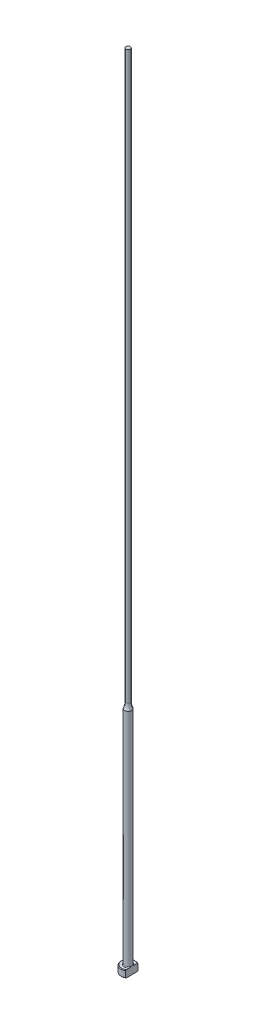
ISO-10303-21;
HEADER;
FILE_DESCRIPTION(('STEP AP214'),'2;1');
FILE_NAME('part.step','',(''),(''),'','','');
FILE_SCHEMA(('AUTOMOTIVE_DESIGN { 1 0 10303 214 1 1 1 1 }'));
ENDSEC;
DATA;
#1=APPLICATION_CONTEXT('core data for automotive mechanical design processes');
#2=APPLICATION_PROTOCOL_DEFINITION('international standard','automotive_design',2000,#1);
#3=PRODUCT_CONTEXT('',#1,'mechanical');
#4=PRODUCT('Part','Part','',(#3));
#5=PRODUCT_RELATED_PRODUCT_CATEGORY('part','',(#4));
#6=PRODUCT_DEFINITION_FORMATION('','',#4);
#7=PRODUCT_DEFINITION_CONTEXT('part definition',#1,'design');
#8=PRODUCT_DEFINITION('design','',#6,#7);
#9=PRODUCT_DEFINITION_SHAPE('','',#8);
#10=(LENGTH_UNIT() NAMED_UNIT(*) SI_UNIT(.MILLI.,.METRE.));
#11=(NAMED_UNIT(*) PLANE_ANGLE_UNIT() SI_UNIT($,.RADIAN.));
#12=(NAMED_UNIT(*) SI_UNIT($,.STERADIAN.) SOLID_ANGLE_UNIT());
#13=UNCERTAINTY_MEASURE_WITH_UNIT(LENGTH_MEASURE(1.E-05),#10,'distance_accuracy_value','');
#14=(GEOMETRIC_REPRESENTATION_CONTEXT(3) GLOBAL_UNCERTAINTY_ASSIGNED_CONTEXT((#13)) GLOBAL_UNIT_ASSIGNED_CONTEXT((#10,
#11,#12)) REPRESENTATION_CONTEXT('',''));
#15=CARTESIAN_POINT('',(0.,0.,0.));
#16=DIRECTION('',(0.,0.,1.));
#17=DIRECTION('',(1.,0.,0.));
#18=AXIS2_PLACEMENT_3D('',#15,#16,#17);
#19=CARTESIAN_POINT('',(-3.17499999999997,3.175,0.));
#20=DIRECTION('',(0.,1.,0.));
#21=DIRECTION('',(0.,0.,1.));
#22=AXIS2_PLACEMENT_3D('',#19,#20,#21);
#23=PLANE('',#22);
#24=CARTESIAN_POINT('',(0.,3.175,0.));
#25=DIRECTION('',(0.,1.,0.));
#26=DIRECTION('',(0.,0.,1.));
#27=AXIS2_PLACEMENT_3D('',#24,#25,#26);
#28=CIRCLE('',#27,2.92099999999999);
#29=CARTESIAN_POINT('',(1.58749999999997,3.175,-2.4519552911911));
#30=VERTEX_POINT('',#29);
#31=CARTESIAN_POINT('',(1.58749999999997,3.175,2.4519552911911));
#32=VERTEX_POINT('',#31);
#33=EDGE_CURVE('E105',#30,#32,#28,.T.);
#34=ORIENTED_EDGE('',*,*,#33,.T.);
#35=DIRECTION('',(0.,0.,1.));
#36=VECTOR('',#35,1.);
#37=CARTESIAN_POINT('',(1.58749999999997,3.17499999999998,2.74963065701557));
#38=LINE('',#37,#36);
#39=CARTESIAN_POINT('',(1.58749999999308,3.175,0.933255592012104));
#40=VERTEX_POINT('',#39);
#41=EDGE_CURVE('E126',#40,#32,#38,.T.);
#42=ORIENTED_EDGE('',*,*,#41,.F.);
#43=CARTESIAN_POINT('',(0.,3.175,0.));
#44=DIRECTION('',(0.,1.,0.));
#45=DIRECTION('',(0.,0.,1.));
#46=AXIS2_PLACEMENT_3D('',#43,#44,#45);
#47=CIRCLE('',#46,1.84149999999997);
#48=CARTESIAN_POINT('',(1.58749999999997,3.17500000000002,-0.933255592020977));
#49=VERTEX_POINT('',#48);
#50=EDGE_CURVE('E11',#40,#49,#47,.F.);
#51=ORIENTED_EDGE('',*,*,#50,.T.);
#52=EDGE_CURVE('E52',#30,#49,#38,.T.);
#53=ORIENTED_EDGE('',*,*,#52,.F.);
#54=EDGE_LOOP('',(#34,#42,#51,#53));
#55=FACE_BOUND('',#54,.T.);
#56=ADVANCED_FACE('F32',(#55),#23,.T.);
#57=CARTESIAN_POINT('',(0.,259.958771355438,0.));
#58=DIRECTION('',(0.,1.,0.));
#59=DIRECTION('',(0.,0.,1.));
#60=AXIS2_PLACEMENT_3D('',#57,#58,#59);
#61=CYLINDRICAL_SURFACE('',#60,3.17499999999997);
#62=CARTESIAN_POINT('',(0.,2.92100000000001,0.));
#63=DIRECTION('',(0.,1.,0.));
#64=DIRECTION('',(0.,0.,1.));
#65=AXIS2_PLACEMENT_3D('',#62,#63,#64);
#66=CIRCLE('',#65,3.17499999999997);
#67=CARTESIAN_POINT('',(1.58749999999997,2.92100000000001,2.74963065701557));
#68=VERTEX_POINT('',#67);
#69=CARTESIAN_POINT('',(1.58749999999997,2.92100000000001,-2.74963065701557));
#70=VERTEX_POINT('',#69);
#71=EDGE_CURVE('E98',#68,#70,#66,.F.);
#72=ORIENTED_EDGE('',*,*,#71,.T.);
#73=DIRECTION('',(0.,-1.,0.));
#74=VECTOR('',#73,1.);
#75=CARTESIAN_POINT('',(1.58749999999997,355.601,-2.74963065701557));
#76=LINE('',#75,#74);
#77=CARTESIAN_POINT('',(1.58749999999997,0.253999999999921,-2.74963065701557));
#78=VERTEX_POINT('',#77);
#79=EDGE_CURVE('E141',#70,#78,#76,.T.);
#80=ORIENTED_EDGE('',*,*,#79,.T.);
#81=CARTESIAN_POINT('',(0.,0.253999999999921,0.));
#82=DIRECTION('',(0.,-1.,0.));
#83=DIRECTION('',(0.,0.,-1.));
#84=AXIS2_PLACEMENT_3D('',#81,#82,#83);
#85=CIRCLE('',#84,3.17499999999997);
#86=CARTESIAN_POINT('',(1.58749999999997,0.253999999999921,2.74963065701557));
#87=VERTEX_POINT('',#86);
#88=EDGE_CURVE('E95',#78,#87,#85,.F.);
#89=ORIENTED_EDGE('',*,*,#88,.T.);
#90=DIRECTION('',(0.,-1.,0.));
#91=VECTOR('',#90,1.);
#92=CARTESIAN_POINT('',(1.58749999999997,355.601,2.74963065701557));
#93=LINE('',#92,#91);
#94=EDGE_CURVE('E88',#68,#87,#93,.T.);
#95=ORIENTED_EDGE('',*,*,#94,.F.);
#96=EDGE_LOOP('',(#72,#80,#89,#95));
#97=FACE_BOUND('',#96,.T.);
#98=ADVANCED_FACE('F191',(#97),#61,.T.);
#99=CARTESIAN_POINT('',(0.,0.,0.));
#100=DIRECTION('',(0.,-1.,0.));
#101=DIRECTION('',(0.,0.,-1.));
#102=AXIS2_PLACEMENT_3D('',#99,#100,#101);
#103=PLANE('',#102);
#104=CARTESIAN_POINT('',(0.,0.,0.));
#105=DIRECTION('',(0.,-1.,0.));
#106=DIRECTION('',(0.,0.,-1.));
#107=AXIS2_PLACEMENT_3D('',#104,#105,#106);
#108=CIRCLE('',#107,2.92100000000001);
#109=CARTESIAN_POINT('',(1.58749999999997,0.,2.45195529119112));
#110=VERTEX_POINT('',#109);
#111=CARTESIAN_POINT('',(1.58749999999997,0.,-2.45195529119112));
#112=VERTEX_POINT('',#111);
#113=EDGE_CURVE('E93',#110,#112,#108,.T.);
#114=ORIENTED_EDGE('',*,*,#113,.T.);
#115=DIRECTION('',(0.,0.,1.));
#116=VECTOR('',#115,1.);
#117=CARTESIAN_POINT('',(1.58749999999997,0.,2.74963065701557));
#118=LINE('',#117,#116);
#119=EDGE_CURVE('E78',#112,#110,#118,.T.);
#120=ORIENTED_EDGE('',*,*,#119,.T.);
#121=EDGE_LOOP('',(#114,#120));
#122=FACE_BOUND('',#121,.T.);
#123=ADVANCED_FACE('F97',(#122),#103,.T.);
#124=CARTESIAN_POINT('',(0.,3.17499999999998,0.));
#125=DIRECTION('',(0.,-1.,0.));
#126=DIRECTION('',(0.,0.,-1.));
#127=AXIS2_PLACEMENT_3D('',#124,#125,#126);
#128=CONICAL_SURFACE('',#127,2.92100000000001,0.785398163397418);
#129=ORIENTED_EDGE('',*,*,#71,.F.);
#130=CARTESIAN_POINT('',(1.58749999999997,-0.161620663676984,-6.0529050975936));
#131=CARTESIAN_POINT('',(1.58749999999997,-0.0288893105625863,-5.91567682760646));
#132=CARTESIAN_POINT('',(1.58749999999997,0.103699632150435,-5.77831035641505));
#133=CARTESIAN_POINT('',(1.58749999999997,0.368508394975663,-5.50321874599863));
#134=CARTESIAN_POINT('',(1.58749999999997,0.5007282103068,-5.3654936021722));
#135=CARTESIAN_POINT('',(1.58749999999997,0.764778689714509,-5.08953516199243));
#136=CARTESIAN_POINT('',(1.58749999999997,0.896609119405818,-4.95130164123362));
#137=CARTESIAN_POINT('',(1.58749999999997,1.15968706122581,-4.67428233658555));
#138=CARTESIAN_POINT('',(1.58749999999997,1.29093457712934,-4.5354965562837));
#139=CARTESIAN_POINT('',(1.58749999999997,1.55007705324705,-4.25997724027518));
#140=CARTESIAN_POINT('',(1.58749999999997,1.67798684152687,-4.12325766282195));
#141=CARTESIAN_POINT('',(1.58749999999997,1.9328486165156,-3.84892898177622));
#142=CARTESIAN_POINT('',(1.58749999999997,2.05980060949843,-3.71131988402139));
#143=CARTESIAN_POINT('',(1.58749999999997,2.31237508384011,-3.43493978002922));
#144=CARTESIAN_POINT('',(1.58749999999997,2.43799784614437,-3.29616903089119));
#145=CARTESIAN_POINT('',(1.58749999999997,2.68741369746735,-3.01699558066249));
#146=CARTESIAN_POINT('',(1.58749999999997,2.81120686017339,-2.8765929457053));
#147=CARTESIAN_POINT('',(1.58749999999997,3.00875865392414,-2.64816703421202));
#148=CARTESIAN_POINT('',(1.58749999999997,3.08336151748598,-2.56087478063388));
#149=CARTESIAN_POINT('',(1.58749999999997,3.23123871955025,-2.385154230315));
#150=CARTESIAN_POINT('',(1.58749999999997,3.30451292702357,-2.29672582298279));
#151=CARTESIAN_POINT('',(1.58749999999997,3.45004422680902,-2.11747400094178));
#152=CARTESIAN_POINT('',(1.58749999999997,3.52228237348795,-2.02663514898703));
#153=CARTESIAN_POINT('',(1.58749999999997,3.66423097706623,-1.84302524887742));
#154=CARTESIAN_POINT('',(1.58749999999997,3.73394203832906,-1.75025467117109));
#155=CARTESIAN_POINT('',(1.58749999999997,3.87080633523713,-1.56067475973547));
#156=CARTESIAN_POINT('',(1.58749999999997,3.93790459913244,-1.46382547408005));
#157=CARTESIAN_POINT('',(1.58749999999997,4.06669147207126,-1.26632594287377));
#158=CARTESIAN_POINT('',(1.58749999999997,4.12837264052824,-1.16567073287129));
#159=CARTESIAN_POINT('',(1.58749999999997,4.21402252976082,-1.01165766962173));
#160=CARTESIAN_POINT('',(1.58749999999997,4.2412792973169,-0.960142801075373));
#161=CARTESIAN_POINT('',(1.58749999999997,4.29309798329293,-0.85578092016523));
#162=CARTESIAN_POINT('',(1.58749999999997,4.3176594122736,-0.802933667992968));
#163=CARTESIAN_POINT('',(1.58749999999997,4.38614656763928,-0.642461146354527));
#164=CARTESIAN_POINT('',(1.58749999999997,4.42510149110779,-0.532518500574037));
#165=CARTESIAN_POINT('',(1.58749999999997,4.46726244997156,-0.367680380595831));
#166=CARTESIAN_POINT('',(1.58749999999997,4.47844427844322,-0.314802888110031));
#167=CARTESIAN_POINT('',(1.58749999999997,4.49576654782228,-0.208209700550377));
#168=CARTESIAN_POINT('',(1.58749999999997,4.50190743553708,-0.154494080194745));
#169=CARTESIAN_POINT('',(1.58749999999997,4.50871296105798,-0.0468792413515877));
#170=CARTESIAN_POINT('',(1.58749999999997,4.50939451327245,0.00701889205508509));
#171=CARTESIAN_POINT('',(1.58749999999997,4.5052767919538,0.114606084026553));
#172=CARTESIAN_POINT('',(1.58749999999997,4.5004770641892,0.16829512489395));
#173=CARTESIAN_POINT('',(1.58749999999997,4.48579689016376,0.274485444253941));
#174=CARTESIAN_POINT('',(1.58749999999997,4.47596081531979,0.326992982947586));
#175=CARTESIAN_POINT('',(1.58749999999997,4.4518180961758,0.430974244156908));
#176=CARTESIAN_POINT('',(1.58749999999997,4.43750969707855,0.482447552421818));
#177=CARTESIAN_POINT('',(1.58749999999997,4.40502489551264,0.58446088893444));
#178=CARTESIAN_POINT('',(1.58749999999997,4.38682724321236,0.634994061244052));
#179=CARTESIAN_POINT('',(1.58749999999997,4.34729308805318,0.734789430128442));
#180=CARTESIAN_POINT('',(1.58749999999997,4.32595722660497,0.784051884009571));
#181=CARTESIAN_POINT('',(1.58749999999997,4.25791922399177,0.93054934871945));
#182=CARTESIAN_POINT('',(1.58749999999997,4.20736047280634,1.02598802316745));
#183=CARTESIAN_POINT('',(1.58749999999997,4.09955451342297,1.21304313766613));
#184=CARTESIAN_POINT('',(1.58749999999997,4.04229912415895,1.30465471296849));
#185=CARTESIAN_POINT('',(1.58749999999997,3.92308746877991,1.48526211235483));
#186=CARTESIAN_POINT('',(1.58749999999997,3.86111349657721,1.57424615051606));
#187=CARTESIAN_POINT('',(1.58749999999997,3.73408621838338,1.74990003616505));
#188=CARTESIAN_POINT('',(1.58749999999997,3.66903444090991,1.83657099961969));
#189=CARTESIAN_POINT('',(1.58749999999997,3.53583371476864,2.009317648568));
#190=CARTESIAN_POINT('',(1.58749999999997,3.46765527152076,2.09537048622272));
#191=CARTESIAN_POINT('',(1.58749999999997,3.32960643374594,2.26611736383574));
#192=CARTESIAN_POINT('',(1.58749999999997,3.25973586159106,2.35081125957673));
#193=CARTESIAN_POINT('',(1.58749999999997,3.04858139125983,2.60290121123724));
#194=CARTESIAN_POINT('',(1.58749999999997,2.90542388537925,2.7687253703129));
#195=CARTESIAN_POINT('',(1.58749999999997,2.64069522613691,3.06970913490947));
#196=CARTESIAN_POINT('',(1.58749999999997,2.5195945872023,3.20528660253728));
#197=CARTESIAN_POINT('',(1.58749999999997,2.27590400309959,3.47510321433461));
#198=CARTESIAN_POINT('',(1.58749999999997,2.1533140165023,3.60934232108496));
#199=CARTESIAN_POINT('',(1.58749999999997,1.9069423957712,3.87695374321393));
#200=CARTESIAN_POINT('',(1.58749999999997,1.78315974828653,4.01032512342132));
#201=CARTESIAN_POINT('',(1.58749999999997,1.53478104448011,4.2763088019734));
#202=CARTESIAN_POINT('',(1.58749999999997,1.41018498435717,4.40892109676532));
#203=CARTESIAN_POINT('',(1.58749999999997,1.04574684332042,4.79499418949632));
#204=CARTESIAN_POINT('',(1.58749999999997,0.805076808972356,5.04767313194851));
#205=CARTESIAN_POINT('',(1.58749999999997,0.44312150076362,5.42550911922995));
#206=CARTESIAN_POINT('',(1.58749999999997,0.322378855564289,5.55118772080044));
#207=CARTESIAN_POINT('',(1.58749999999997,0.0805914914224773,5.8022520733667));
#208=CARTESIAN_POINT('',(1.58749999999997,-0.0404532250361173,5.92763782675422));
#209=CARTESIAN_POINT('',(1.58749999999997,-0.161620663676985,6.0529050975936));
#210=B_SPLINE_CURVE_WITH_KNOTS('',3,(#130,#131,#132,#133,#134,#135,#136,#137,#138,#139,#140,
#141,#142,#143,#144,#145,#146,#147,#148,#149,#150,#151,#152,#153,#154,#155,#156,#157,#158,#159,
#160,#161,#162,#163,#164,#165,#166,#167,#168,#169,#170,#171,#172,#173,#174,#175,#176,#177,#178,
#179,#180,#181,#182,#183,#184,#185,#186,#187,#188,#189,#190,#191,#192,#193,#194,#195,#196,#197,
#198,#199,#200,#201,#202,#203,#204,#205,#206,#207,#208,#209),.UNSPECIFIED.,.F.,.F.,(4,2,2,2,2,2,
2,2,2,2,2,2,2,2,2,2,2,2,2,2,2,2,2,2,2,2,2,2,2,2,2,2,2,2,2,2,2,2,2,4),(0.,0.572750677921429,
1.14550874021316,1.71856057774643,2.29160869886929,2.85328006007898,3.41494773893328,
3.97649423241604,4.53801804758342,4.88249307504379,5.2270018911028,5.57515326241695,
5.92322081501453,6.27657800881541,6.63041319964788,6.80518126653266,6.97998101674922,
7.32824262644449,7.49018491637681,7.65211285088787,7.81353889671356,7.97497832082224,
8.13501929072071,8.29512313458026,8.45612518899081,8.61709438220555,8.94062993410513,
9.26456495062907,9.58978187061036,9.91483894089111,10.2441741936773,10.5735441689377,
11.2306812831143,11.7760337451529,12.3214014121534,12.8672825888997,13.4131663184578,
14.4600164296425,14.9828595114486,15.505698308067),.UNSPECIFIED.);
#211=EDGE_CURVE('E118',#32,#68,#210,.T.);
#212=ORIENTED_EDGE('',*,*,#211,.F.);
#213=ORIENTED_EDGE('',*,*,#33,.F.);
#214=EDGE_CURVE('E117',#70,#30,#210,.T.);
#215=ORIENTED_EDGE('',*,*,#214,.F.);
#216=EDGE_LOOP('',(#129,#212,#213,#215));
#217=FACE_BOUND('',#216,.T.);
#218=ADVANCED_FACE('F162',(#217),#128,.T.);
#219=CARTESIAN_POINT('',(0.,0.253999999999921,0.));
#220=DIRECTION('',(0.,1.,0.));
#221=DIRECTION('',(0.,0.,1.));
#222=AXIS2_PLACEMENT_3D('',#219,#220,#221);
#223=CONICAL_SURFACE('',#222,3.17499999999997,0.785398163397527);
#224=ORIENTED_EDGE('',*,*,#88,.F.);
#225=CARTESIAN_POINT('',(1.58749999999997,3.33662066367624,6.0529050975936));
#226=CARTESIAN_POINT('',(1.58749999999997,3.20388931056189,5.91567682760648));
#227=CARTESIAN_POINT('',(1.58749999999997,3.07130036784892,5.7783103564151));
#228=CARTESIAN_POINT('',(1.58749999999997,2.80649160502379,5.50321874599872));
#229=CARTESIAN_POINT('',(1.58749999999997,2.6742717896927,5.36549360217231));
#230=CARTESIAN_POINT('',(1.58749999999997,2.41022131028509,5.08953516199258));
#231=CARTESIAN_POINT('',(1.58749999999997,2.27839088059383,4.95130164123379));
#232=CARTESIAN_POINT('',(1.58749999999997,2.01531293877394,4.67428233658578));
#233=CARTESIAN_POINT('',(1.58749999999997,1.88406542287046,4.53549655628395));
#234=CARTESIAN_POINT('',(1.58749999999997,1.62492294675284,4.25997724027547));
#235=CARTESIAN_POINT('',(1.58749999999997,1.49701315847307,4.12325766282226));
#236=CARTESIAN_POINT('',(1.58749999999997,1.24215138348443,3.84892898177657));
#237=CARTESIAN_POINT('',(1.58749999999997,1.11519939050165,3.71131988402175));
#238=CARTESIAN_POINT('',(1.58749999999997,0.862624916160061,3.43493978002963));
#239=CARTESIAN_POINT('',(1.58749999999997,0.737002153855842,3.29616903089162));
#240=CARTESIAN_POINT('',(1.58749999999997,0.487586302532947,3.01699558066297));
#241=CARTESIAN_POINT('',(1.58749999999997,0.363793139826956,2.8765929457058));
#242=CARTESIAN_POINT('',(1.58749999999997,0.166241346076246,2.64816703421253));
#243=CARTESIAN_POINT('',(1.58749999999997,0.0916384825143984,2.56087478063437));
#244=CARTESIAN_POINT('',(1.58749999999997,-0.0562387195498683,2.38515423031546));
#245=CARTESIAN_POINT('',(1.58749999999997,-0.129512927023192,2.29672582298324));
#246=CARTESIAN_POINT('',(1.58749999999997,-0.275044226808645,2.1174740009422));
#247=CARTESIAN_POINT('',(1.58749999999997,-0.347282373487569,2.02663514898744));
#248=CARTESIAN_POINT('',(1.58749999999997,-0.489230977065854,1.8430252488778));
#249=CARTESIAN_POINT('',(1.58749999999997,-0.558942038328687,1.75025467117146));
#250=CARTESIAN_POINT('',(1.58749999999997,-0.695806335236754,1.5606747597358));
#251=CARTESIAN_POINT('',(1.58749999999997,-0.762904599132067,1.46382547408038));
#252=CARTESIAN_POINT('',(1.58749999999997,-0.89169147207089,1.26632594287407));
#253=CARTESIAN_POINT('',(1.58749999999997,-0.953372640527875,1.16567073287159));
#254=CARTESIAN_POINT('',(1.58749999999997,-1.03902252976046,1.01165766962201));
#255=CARTESIAN_POINT('',(1.58749999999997,-1.06627929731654,0.960142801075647));
#256=CARTESIAN_POINT('',(1.58749999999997,-1.11809798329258,0.855780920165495));
#257=CARTESIAN_POINT('',(1.58749999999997,-1.14265941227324,0.802933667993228));
#258=CARTESIAN_POINT('',(1.58749999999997,-1.21114656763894,0.642461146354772));
#259=CARTESIAN_POINT('',(1.58749999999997,-1.25010149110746,0.532518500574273));
#260=CARTESIAN_POINT('',(1.58749999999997,-1.29226244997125,0.367680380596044));
#261=CARTESIAN_POINT('',(1.58749999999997,-1.30344427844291,0.314802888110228));
#262=CARTESIAN_POINT('',(1.58749999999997,-1.32076654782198,0.208209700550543));
#263=CARTESIAN_POINT('',(1.58749999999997,-1.32690743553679,0.154494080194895));
#264=CARTESIAN_POINT('',(1.58749999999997,-1.3337129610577,0.0468792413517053));
#265=CARTESIAN_POINT('',(1.58749999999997,-1.33439451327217,-0.00701889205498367));
#266=CARTESIAN_POINT('',(1.58749999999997,-1.33027679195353,-0.114606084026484));
#267=CARTESIAN_POINT('',(1.58749999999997,-1.32547706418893,-0.168295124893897));
#268=CARTESIAN_POINT('',(1.58749999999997,-1.31079689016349,-0.274485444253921));
#269=CARTESIAN_POINT('',(1.58749999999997,-1.30096081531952,-0.326992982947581));
#270=CARTESIAN_POINT('',(1.58749999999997,-1.27681809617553,-0.430974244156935));
#271=CARTESIAN_POINT('',(1.58749999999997,-1.26250969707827,-0.48244755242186));
#272=CARTESIAN_POINT('',(1.58749999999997,-1.23002489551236,-0.584460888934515));
#273=CARTESIAN_POINT('',(1.58749999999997,-1.21182724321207,-0.634994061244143));
#274=CARTESIAN_POINT('',(1.58749999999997,-1.17229308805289,-0.734789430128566));
#275=CARTESIAN_POINT('',(1.58749999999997,-1.15095722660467,-0.784051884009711));
#276=CARTESIAN_POINT('',(1.58749999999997,-1.08291922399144,-0.930549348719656));
#277=CARTESIAN_POINT('',(1.58749999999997,-1.03236047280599,-1.0259880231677));
#278=CARTESIAN_POINT('',(1.58749999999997,-0.924554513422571,-1.21304313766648));
#279=CARTESIAN_POINT('',(1.58749999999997,-0.867299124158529,-1.30465471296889));
#280=CARTESIAN_POINT('',(1.58749999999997,-0.748087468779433,-1.48526211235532));
#281=CARTESIAN_POINT('',(1.58749999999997,-0.686113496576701,-1.5742461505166));
#282=CARTESIAN_POINT('',(1.58749999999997,-0.559086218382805,-1.74990003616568));
#283=CARTESIAN_POINT('',(1.58749999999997,-0.494034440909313,-1.83657099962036));
#284=CARTESIAN_POINT('',(1.58749999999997,-0.360833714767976,-2.00931764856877));
#285=CARTESIAN_POINT('',(1.58749999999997,-0.292655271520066,-2.09537048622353));
#286=CARTESIAN_POINT('',(1.58749999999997,-0.154606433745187,-2.26611736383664));
#287=CARTESIAN_POINT('',(1.58749999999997,-0.0847358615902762,-2.35081125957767));
#288=CARTESIAN_POINT('',(1.58749999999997,0.126418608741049,-2.60290121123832));
#289=CARTESIAN_POINT('',(1.58749999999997,0.269576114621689,-2.76872537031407));
#290=CARTESIAN_POINT('',(1.58749999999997,0.534304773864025,-3.06970913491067));
#291=CARTESIAN_POINT('',(1.58749999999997,0.655405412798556,-3.20528660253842));
#292=CARTESIAN_POINT('',(1.58749999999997,0.899095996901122,-3.47510321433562));
#293=CARTESIAN_POINT('',(1.58749999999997,1.02168598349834,-3.60934232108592));
#294=CARTESIAN_POINT('',(1.58749999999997,1.26805760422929,-3.87695374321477));
#295=CARTESIAN_POINT('',(1.58749999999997,1.39184025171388,-4.0103251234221));
#296=CARTESIAN_POINT('',(1.58749999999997,1.64021895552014,-4.27630880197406));
#297=CARTESIAN_POINT('',(1.58749999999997,1.76481501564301,-4.40892109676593));
#298=CARTESIAN_POINT('',(1.58749999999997,2.12925315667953,-4.79499418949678));
#299=CARTESIAN_POINT('',(1.58749999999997,2.36992319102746,-5.04767313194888));
#300=CARTESIAN_POINT('',(1.58749999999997,2.73187849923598,-5.42550911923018));
#301=CARTESIAN_POINT('',(1.58749999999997,2.85262114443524,-5.55118772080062));
#302=CARTESIAN_POINT('',(1.58749999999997,3.09440850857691,-5.80225207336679));
#303=CARTESIAN_POINT('',(1.58749999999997,3.21545322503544,-5.92763782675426));
#304=CARTESIAN_POINT('',(1.58749999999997,3.33662066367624,-6.0529050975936));
#305=B_SPLINE_CURVE_WITH_KNOTS('',3,(#225,#226,#227,#228,#229,#230,#231,#232,#233,#234,#235,
#236,#237,#238,#239,#240,#241,#242,#243,#244,#245,#246,#247,#248,#249,#250,#251,#252,#253,#254,
#255,#256,#257,#258,#259,#260,#261,#262,#263,#264,#265,#266,#267,#268,#269,#270,#271,#272,#273,
#274,#275,#276,#277,#278,#279,#280,#281,#282,#283,#284,#285,#286,#287,#288,#289,#290,#291,#292,
#293,#294,#295,#296,#297,#298,#299,#300,#301,#302,#303,#304),.UNSPECIFIED.,.F.,.F.,(4,2,2,2,2,2,
2,2,2,2,2,2,2,2,2,2,2,2,2,2,2,2,2,2,2,2,2,2,2,2,2,2,2,2,2,2,2,2,2,4),(0.,0.572750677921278,
1.14550874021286,1.71856057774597,2.29160869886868,2.85328006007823,3.4149477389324,
3.97649423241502,4.53801804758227,4.88249307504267,5.22700189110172,5.5751532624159,
5.92322081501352,6.27657800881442,6.63041319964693,6.80518126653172,6.9799810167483,
7.3282426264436,7.49018491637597,7.65211285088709,7.81353889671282,7.97497832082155,
8.13501929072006,8.29512313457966,8.45612518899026,8.61709438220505,8.9406299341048,
9.2645649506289,9.58978187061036,9.91483894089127,10.2441741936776,10.5735441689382,
11.2306812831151,11.7760337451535,12.3214014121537,12.8672825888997,13.4131663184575,
14.4600164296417,14.9828595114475,15.5056983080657),.UNSPECIFIED.);
#306=EDGE_CURVE('E81',#112,#78,#305,.T.);
#307=ORIENTED_EDGE('',*,*,#306,.F.);
#308=ORIENTED_EDGE('',*,*,#113,.F.);
#309=EDGE_CURVE('E84',#87,#110,#305,.T.);
#310=ORIENTED_EDGE('',*,*,#309,.F.);
#311=EDGE_LOOP('',(#224,#307,#308,#310));
#312=FACE_BOUND('',#311,.T.);
#313=ADVANCED_FACE('F92',(#312),#223,.T.);
#314=CARTESIAN_POINT('',(0.,3.42900000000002,0.));
#315=DIRECTION('',(0.,1.,0.));
#316=DIRECTION('',(0.,0.,1.));
#317=AXIS2_PLACEMENT_3D('',#314,#315,#316);
#318=TOROIDAL_SURFACE('',#317,1.84149999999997,0.254);
#319=CARTESIAN_POINT('',(1.58749999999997,3.42900000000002,0.));
#320=CARTESIAN_POINT('',(1.58749999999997,3.42899942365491,-1.9220514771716E-10));
#321=CARTESIAN_POINT('',(1.58749999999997,3.42899884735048,-1.2261161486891E-07));
#322=CARTESIAN_POINT('',(1.58749999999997,3.42899773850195,-5.09676365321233E-07));
#323=CARTESIAN_POINT('',(1.58749999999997,3.42899720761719,-7.78176328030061E-07));
#324=CARTESIAN_POINT('',(1.58749999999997,3.42899614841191,-1.42307272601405E-06));
#325=CARTESIAN_POINT('',(1.58749999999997,3.42899562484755,-1.80713867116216E-06));
#326=CARTESIAN_POINT('',(1.58749999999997,3.42899463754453,-2.63494846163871E-06));
#327=CARTESIAN_POINT('',(1.58749999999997,3.42899417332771,-3.07814756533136E-06));
#328=CARTESIAN_POINT('',(1.58749999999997,3.42899261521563,-4.66897357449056E-06));
#329=CARTESIAN_POINT('',(1.58749999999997,3.42899159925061,-5.89404908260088E-06));
#330=CARTESIAN_POINT('',(1.58749999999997,3.42898979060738,-8.42427511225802E-06));
#331=CARTESIAN_POINT('',(1.58749999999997,3.42898899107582,-9.7248057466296E-06));
#332=CARTESIAN_POINT('',(1.58749999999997,3.42898598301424,-1.48060601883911E-05));
#333=CARTESIAN_POINT('',(1.58749999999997,3.42898393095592,-1.86838281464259E-05));
#334=CARTESIAN_POINT('',(1.58749999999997,3.42898057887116,-2.63261117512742E-05));
#335=CARTESIAN_POINT('',(1.58749999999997,3.42897922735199,-3.00687417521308E-05));
#336=CARTESIAN_POINT('',(1.58749999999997,3.42897347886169,-4.60276298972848E-05));
#337=CARTESIAN_POINT('',(1.58749999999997,3.42896911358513,-5.8247019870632E-05));
#338=CARTESIAN_POINT('',(1.58749999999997,3.42896211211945,-8.11070097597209E-05));
#339=CARTESIAN_POINT('',(1.58749999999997,3.42895931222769,-9.16953114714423E-05));
#340=CARTESIAN_POINT('',(1.58749999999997,3.42893712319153,-0.000168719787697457));
#341=CARTESIAN_POINT('',(1.58749999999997,3.42890881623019,-0.000232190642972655));
#342=CARTESIAN_POINT('',(1.58749999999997,3.42880276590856,-0.000479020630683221));
#343=CARTESIAN_POINT('',(1.58749999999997,3.42873165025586,-0.00066443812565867));
#344=CARTESIAN_POINT('',(1.58749999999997,3.42845137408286,-0.0013844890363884));
#345=CARTESIAN_POINT('',(1.58749999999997,3.42823526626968,-0.00191701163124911));
#346=CARTESIAN_POINT('',(1.58749999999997,3.42735449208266,-0.00409774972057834));
#347=CARTESIAN_POINT('',(1.58749999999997,3.42669768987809,-0.00574830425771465));
#348=CARTESIAN_POINT('',(1.58749999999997,3.4174405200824,-0.0289985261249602));
#349=CARTESIAN_POINT('',(1.58749999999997,3.40878325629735,-0.0505816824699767));
#350=CARTESIAN_POINT('',(1.58749999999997,3.39189297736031,-0.0929947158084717));
#351=CARTESIAN_POINT('',(1.58749999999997,3.38365605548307,-0.11382315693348));
#352=CARTESIAN_POINT('',(1.58749999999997,3.36635393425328,-0.157956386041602));
#353=CARTESIAN_POINT('',(1.58749999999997,3.35730391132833,-0.181267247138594));
#354=CARTESIAN_POINT('',(1.58749999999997,3.33936775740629,-0.228222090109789));
#355=CARTESIAN_POINT('',(1.58749999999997,3.33048420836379,-0.25186705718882));
#356=CARTESIAN_POINT('',(1.58749999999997,3.30894496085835,-0.310512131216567));
#357=CARTESIAN_POINT('',(1.58749999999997,3.29649449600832,-0.345588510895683));
#358=CARTESIAN_POINT('',(1.58749999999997,3.27296975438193,-0.415278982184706));
#359=CARTESIAN_POINT('',(1.58749999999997,3.26186987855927,-0.449884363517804));
#360=CARTESIAN_POINT('',(1.58749999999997,3.2395832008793,-0.524471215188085));
#361=CARTESIAN_POINT('',(1.58749999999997,3.22860862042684,-0.564517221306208));
#362=CARTESIAN_POINT('',(1.58749999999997,3.20902534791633,-0.645529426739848));
#363=CARTESIAN_POINT('',(1.58749999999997,3.20043582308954,-0.686500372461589));
#364=CARTESIAN_POINT('',(1.58749999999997,3.18611712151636,-0.771546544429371));
#365=CARTESIAN_POINT('',(1.58749999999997,3.18059550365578,-0.815658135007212));
#366=CARTESIAN_POINT('',(1.58749999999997,3.17455396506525,-0.904117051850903));
#367=CARTESIAN_POINT('',(1.58749999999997,3.17401361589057,-0.948462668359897));
#368=CARTESIAN_POINT('',(1.58749999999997,3.17898948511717,-1.02531896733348));
#369=CARTESIAN_POINT('',(1.58749999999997,3.1829739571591,-1.05792141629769));
#370=CARTESIAN_POINT('',(1.58749999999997,3.19569167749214,-1.12184393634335));
#371=CARTESIAN_POINT('',(1.58749999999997,3.20436049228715,-1.1531753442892));
#372=CARTESIAN_POINT('',(1.58749999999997,3.22236152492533,-1.19946468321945));
#373=CARTESIAN_POINT('',(1.58749999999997,3.2295150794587,-1.21526783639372));
#374=CARTESIAN_POINT('',(1.58749999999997,3.24587062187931,-1.24583726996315));
#375=CARTESIAN_POINT('',(1.58749999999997,3.25507530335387,-1.26060215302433));
#376=CARTESIAN_POINT('',(1.58749999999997,3.27378481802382,-1.28575815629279));
#377=CARTESIAN_POINT('',(1.58749999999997,3.28289001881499,-1.29644383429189));
#378=CARTESIAN_POINT('',(1.58749999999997,3.30268460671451,-1.31623154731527));
#379=CARTESIAN_POINT('',(1.58749999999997,3.31337067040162,-1.32533681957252));
#380=CARTESIAN_POINT('',(1.58749999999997,3.33349977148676,-1.33941140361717));
#381=CARTESIAN_POINT('',(1.58749999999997,3.34261446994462,-1.34484814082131));
#382=CARTESIAN_POINT('',(1.58749999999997,3.36161455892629,-1.35416329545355));
#383=CARTESIAN_POINT('',(1.58749999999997,3.37149946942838,-1.35804267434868));
#384=CARTESIAN_POINT('',(1.58749999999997,3.39188678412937,-1.36398436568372));
#385=CARTESIAN_POINT('',(1.58749999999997,3.40239309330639,-1.36603350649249));
#386=CARTESIAN_POINT('',(1.58749999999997,3.42360372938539,-1.3680840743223));
#387=CARTESIAN_POINT('',(1.58749999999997,3.43430795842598,-1.36808648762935));
#388=CARTESIAN_POINT('',(1.58749999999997,3.45433283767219,-1.36616208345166));
#389=CARTESIAN_POINT('',(1.58749999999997,3.46367506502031,-1.36444960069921));
#390=CARTESIAN_POINT('',(1.58749999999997,3.48195519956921,-1.35953338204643));
#391=CARTESIAN_POINT('',(1.58749999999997,3.49089304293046,-1.3563294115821));
#392=CARTESIAN_POINT('',(1.58749999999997,3.50850302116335,-1.34848006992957));
#393=CARTESIAN_POINT('',(1.58749999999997,3.5171531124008,-1.34378578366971));
#394=CARTESIAN_POINT('',(1.58749999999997,3.53371257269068,-1.33324445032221));
#395=CARTESIAN_POINT('',(1.58749999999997,3.54162163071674,-1.32739692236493));
#396=CARTESIAN_POINT('',(1.58749999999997,3.56107121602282,-1.31107304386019));
#397=CARTESIAN_POINT('',(1.58749999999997,3.57202221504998,-1.29989286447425));
#398=CARTESIAN_POINT('',(1.58749999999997,3.59202509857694,-1.27593566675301));
#399=CARTESIAN_POINT('',(1.58749999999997,3.60107086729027,-1.26315370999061));
#400=CARTESIAN_POINT('',(1.58749999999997,3.62186023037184,-1.22930733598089));
#401=CARTESIAN_POINT('',(1.58749999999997,3.63240584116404,-1.20751096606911));
#402=CARTESIAN_POINT('',(1.58749999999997,3.65004643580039,-1.16266144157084));
#403=CARTESIAN_POINT('',(1.58749999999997,3.65714435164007,-1.13960937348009));
#404=CARTESIAN_POINT('',(1.58749999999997,3.67265428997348,-1.07603916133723));
#405=CARTESIAN_POINT('',(1.58749999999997,3.67834921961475,-1.03486686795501));
#406=CARTESIAN_POINT('',(1.58749999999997,3.68382880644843,-0.951558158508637));
#407=CARTESIAN_POINT('',(1.58749999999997,3.68350976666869,-0.909417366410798));
#408=CARTESIAN_POINT('',(1.58749999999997,3.67745397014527,-0.811383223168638));
#409=CARTESIAN_POINT('',(1.58749999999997,3.66993873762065,-0.755610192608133));
#410=CARTESIAN_POINT('',(1.58749999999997,3.64933373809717,-0.644937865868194));
#411=CARTESIAN_POINT('',(1.58749999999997,3.63621897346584,-0.59004364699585));
#412=CARTESIAN_POINT('',(1.58749999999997,3.60740922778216,-0.485757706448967));
#413=CARTESIAN_POINT('',(1.58749999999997,3.59201096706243,-0.436281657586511));
#414=CARTESIAN_POINT('',(1.58749999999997,3.55922497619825,-0.338551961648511));
#415=CARTESIAN_POINT('',(1.58749999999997,3.5418584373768,-0.290291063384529));
#416=CARTESIAN_POINT('',(1.58749999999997,3.51760237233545,-0.225557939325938));
#417=CARTESIAN_POINT('',(1.58749999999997,3.51126413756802,-0.208874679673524));
#418=CARTESIAN_POINT('',(1.58749999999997,3.49830042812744,-0.17512392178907));
#419=CARTESIAN_POINT('',(1.58749999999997,3.49167176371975,-0.158057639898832));
#420=CARTESIAN_POINT('',(1.58749999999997,3.47585523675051,-0.117638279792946));
#421=CARTESIAN_POINT('',(1.58749999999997,3.46662970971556,-0.0943002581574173));
#422=CARTESIAN_POINT('',(1.58749999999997,3.44889695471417,-0.0497824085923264));
#423=CARTESIAN_POINT('',(1.58749999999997,3.44040039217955,-0.028598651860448));
#424=CARTESIAN_POINT('',(1.58749999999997,3.43130364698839,-0.00575168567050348));
#425=CARTESIAN_POINT('',(1.58749999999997,3.43064818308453,-0.00410451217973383));
#426=CARTESIAN_POINT('',(1.58749999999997,3.42976776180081,-0.00192459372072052));
#427=CARTESIAN_POINT('',(1.58749999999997,3.42955062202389,-0.00138952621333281));
#428=CARTESIAN_POINT('',(1.58749999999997,3.42926908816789,-0.000666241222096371));
#429=CARTESIAN_POINT('',(1.58749999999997,3.42919771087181,-0.000480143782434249));
#430=CARTESIAN_POINT('',(1.58749999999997,3.42909131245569,-0.000232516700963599));
#431=CARTESIAN_POINT('',(1.58749999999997,3.42906294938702,-0.000168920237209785));
#432=CARTESIAN_POINT('',(1.58749999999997,3.42904072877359,-9.17527162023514E-05));
#433=CARTESIAN_POINT('',(1.58749999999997,3.42903792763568,-8.11550293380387E-05));
#434=CARTESIAN_POINT('',(1.58749999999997,3.42903091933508,-5.82743948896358E-05));
#435=CARTESIAN_POINT('',(1.58749999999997,3.42902654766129,-4.60440001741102E-05));
#436=CARTESIAN_POINT('',(1.58749999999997,3.42902079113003,-3.00727682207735E-05));
#437=CARTESIAN_POINT('',(1.58749999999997,3.42901943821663,-2.63286807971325E-05));
#438=CARTESIAN_POINT('',(1.58749999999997,3.42901608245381,-1.86836529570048E-05));
#439=CARTESIAN_POINT('',(1.58749999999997,3.4290140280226,-1.48046517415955E-05));
#440=CARTESIAN_POINT('',(1.58749999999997,3.42901101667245,-9.72223943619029E-06));
#441=CARTESIAN_POINT('',(1.58749999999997,3.42901021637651,-8.42159649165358E-06));
#442=CARTESIAN_POINT('',(1.58749999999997,3.42900840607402,-5.89129729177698E-06));
#443=CARTESIAN_POINT('',(1.58749999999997,3.42900738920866,-4.66626867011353E-06));
#444=CARTESIAN_POINT('',(1.58749999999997,3.42900582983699,-3.07568803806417E-06));
#445=CARTESIAN_POINT('',(1.58749999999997,3.42900536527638,-2.63259565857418E-06));
#446=CARTESIAN_POINT('',(1.58749999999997,3.4290043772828,-1.80506085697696E-06));
#447=CARTESIAN_POINT('',(1.58749999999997,3.42900385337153,-1.42116387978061E-06));
#448=CARTESIAN_POINT('',(1.58749999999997,3.42900279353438,-7.76675643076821E-07));
#449=CARTESIAN_POINT('',(1.58749999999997,3.42900226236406,-5.08406487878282E-07));
#450=CARTESIAN_POINT('',(1.58749999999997,3.42900115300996,-1.21901887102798E-07));
#451=CARTESIAN_POINT('',(1.58749999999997,3.42900057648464,1.92251677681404E-10));
#452=CARTESIAN_POINT('',(1.58749999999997,3.42900000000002,0.));
#453=B_SPLINE_CURVE_WITH_KNOTS('',3,(#319,#320,#321,#322,#323,#324,#325,#326,#327,#328,#329,
#330,#331,#332,#333,#334,#335,#336,#337,#338,#339,#340,#341,#342,#343,#344,#345,#346,#347,#348,
#349,#350,#351,#352,#353,#354,#355,#356,#357,#358,#359,#360,#361,#362,#363,#364,#365,#366,#367,
#368,#369,#370,#371,#372,#373,#374,#375,#376,#377,#378,#379,#380,#381,#382,#383,#384,#385,#386,
#387,#388,#389,#390,#391,#392,#393,#394,#395,#396,#397,#398,#399,#400,#401,#402,#403,#404,#405,
#406,#407,#408,#409,#410,#411,#412,#413,#414,#415,#416,#417,#418,#419,#420,#421,#422,#423,#424,
#425,#426,#427,#428,#429,#430,#431,#432,#433,#434,#435,#436,#437,#438,#439,#440,#441,#442,#443,
#444,#445,#446,#447,#448,#449,#450,#451,#452),.UNSPECIFIED.,.T.,.F.,(4,2,2,2,2,2,2,2,2,2,2,2,2,
2,2,2,2,2,2,2,2,2,2,2,2,2,2,2,2,2,2,2,2,2,2,2,2,2,2,2,2,2,2,2,2,2,2,2,2,2,2,2,2,2,2,2,2,2,2,2,2,
2,2,2,2,2,4),(0.,1.72815458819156E-06,3.50429255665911E-06,5.44431004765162E-06,
7.3675525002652E-06,1.2119089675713E-05,1.66953775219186E-05,2.98160400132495E-05,
4.17409564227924E-05,8.0660475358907E-05,0.000113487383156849,0.000321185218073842,
0.000917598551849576,0.00264089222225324,0.00797105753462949,0.0777276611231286,
0.144923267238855,0.219939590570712,0.295714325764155,0.407362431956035,0.516367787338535,
0.640878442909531,0.766362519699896,0.899536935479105,1.03216495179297,1.13045740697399,
1.22743103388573,1.27935899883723,1.33135556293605,1.37333248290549,1.41522237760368,
1.44693946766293,1.47863694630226,1.51056074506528,1.54246916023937,1.57083210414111,
1.59919951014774,1.62861579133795,1.65804436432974,1.70472658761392,1.75155645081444,
1.82378709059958,1.89595619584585,2.01995471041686,2.1460932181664,2.31447224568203,
2.48361094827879,2.6389891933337,2.79283011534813,2.84637031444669,2.9012946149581,
2.97658236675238,3.04504771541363,3.05036697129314,3.05209849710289,3.05269709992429,
3.05290520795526,3.05293806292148,3.05297701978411,3.05298895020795,3.05300207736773,
3.05300665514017,3.0530114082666,3.05301333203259,3.05301527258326,3.05301704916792,
3.05301877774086),.UNSPECIFIED.);
#454=CARTESIAN_POINT('',(1.58749999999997,3.42900000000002,0.));
#455=VERTEX_POINT('',#454);
#456=EDGE_CURVE('E47',#455,#49,#453,.T.);
#457=ORIENTED_EDGE('',*,*,#456,.T.);
#458=ORIENTED_EDGE('',*,*,#50,.F.);
#459=CARTESIAN_POINT('',(1.58749999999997,3.42900000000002,0.));
#460=CARTESIAN_POINT('',(1.58749999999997,3.42900057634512,1.9220512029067E-10));
#461=CARTESIAN_POINT('',(1.58749999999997,3.42900115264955,1.22611614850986E-07));
#462=CARTESIAN_POINT('',(1.58749999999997,3.42900226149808,5.09676365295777E-07));
#463=CARTESIAN_POINT('',(1.58749999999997,3.42900279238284,7.78176328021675E-07));
#464=CARTESIAN_POINT('',(1.58749999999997,3.42900385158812,1.42307272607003E-06));
#465=CARTESIAN_POINT('',(1.58749999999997,3.42900437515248,1.80713867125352E-06));
#466=CARTESIAN_POINT('',(1.58749999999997,3.4290053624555,2.63494846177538E-06));
#467=CARTESIAN_POINT('',(1.58749999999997,3.42900582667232,3.0781475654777E-06));
#468=CARTESIAN_POINT('',(1.58749999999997,3.4290073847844,4.66897357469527E-06));
#469=CARTESIAN_POINT('',(1.58749999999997,3.42900840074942,5.89404908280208E-06));
#470=CARTESIAN_POINT('',(1.58749999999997,3.42901020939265,8.42427511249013E-06));
#471=CARTESIAN_POINT('',(1.58749999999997,3.42901100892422,9.72480574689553E-06));
#472=CARTESIAN_POINT('',(1.58749999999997,3.42901401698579,1.48060601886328E-05));
#473=CARTESIAN_POINT('',(1.58749999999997,3.42901606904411,1.86838281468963E-05));
#474=CARTESIAN_POINT('',(1.58749999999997,3.42901942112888,2.63261117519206E-05));
#475=CARTESIAN_POINT('',(1.58749999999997,3.42902077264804,3.00687417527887E-05));
#476=CARTESIAN_POINT('',(1.58749999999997,3.42902652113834,4.60276298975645E-05));
#477=CARTESIAN_POINT('',(1.58749999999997,3.4290308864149,5.82470198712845E-05));
#478=CARTESIAN_POINT('',(1.58749999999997,3.42903788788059,8.11070097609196E-05));
#479=CARTESIAN_POINT('',(1.58749999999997,3.42904068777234,9.16953114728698E-05));
#480=CARTESIAN_POINT('',(1.58749999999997,3.4290628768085,0.000168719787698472));
#481=CARTESIAN_POINT('',(1.58749999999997,3.42909118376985,0.000232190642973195));
#482=CARTESIAN_POINT('',(1.58749999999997,3.42919723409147,0.000479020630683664));
#483=CARTESIAN_POINT('',(1.58749999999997,3.42926834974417,0.000664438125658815));
#484=CARTESIAN_POINT('',(1.58749999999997,3.42954862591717,0.00138448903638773));
#485=CARTESIAN_POINT('',(1.58749999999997,3.42976473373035,0.00191701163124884));
#486=CARTESIAN_POINT('',(1.58749999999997,3.43064550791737,0.00409774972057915));
#487=CARTESIAN_POINT('',(1.58749999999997,3.43130231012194,0.00574830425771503));
#488=CARTESIAN_POINT('',(1.58749999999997,3.44055947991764,0.0289985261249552));
#489=CARTESIAN_POINT('',(1.58749999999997,3.44921674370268,0.0505816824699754));
#490=CARTESIAN_POINT('',(1.58749999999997,3.46610702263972,0.0929947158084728));
#491=CARTESIAN_POINT('',(1.58749999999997,3.47434394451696,0.11382315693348));
#492=CARTESIAN_POINT('',(1.58749999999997,3.49164606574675,0.157956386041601));
#493=CARTESIAN_POINT('',(1.58749999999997,3.5006960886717,0.181267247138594));
#494=CARTESIAN_POINT('',(1.58749999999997,3.51863224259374,0.228222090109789));
#495=CARTESIAN_POINT('',(1.58749999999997,3.52751579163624,0.25186705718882));
#496=CARTESIAN_POINT('',(1.58749999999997,3.54905503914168,0.310512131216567));
#497=CARTESIAN_POINT('',(1.58749999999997,3.56150550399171,0.345588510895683));
#498=CARTESIAN_POINT('',(1.58749999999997,3.5850302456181,0.415278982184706));
#499=CARTESIAN_POINT('',(1.58749999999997,3.59613012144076,0.449884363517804));
#500=CARTESIAN_POINT('',(1.58749999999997,3.61841679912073,0.524471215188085));
#501=CARTESIAN_POINT('',(1.58749999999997,3.62939137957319,0.564517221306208));
#502=CARTESIAN_POINT('',(1.58749999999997,3.6489746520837,0.645529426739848));
#503=CARTESIAN_POINT('',(1.58749999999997,3.65756417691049,0.686500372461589));
#504=CARTESIAN_POINT('',(1.58749999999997,3.67188287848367,0.771546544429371));
#505=CARTESIAN_POINT('',(1.58749999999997,3.67740449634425,0.815658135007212));
#506=CARTESIAN_POINT('',(1.58749999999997,3.68344603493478,0.904117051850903));
#507=CARTESIAN_POINT('',(1.58749999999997,3.68398638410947,0.948462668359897));
#508=CARTESIAN_POINT('',(1.58749999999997,3.67901051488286,1.02531896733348));
#509=CARTESIAN_POINT('',(1.58749999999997,3.67502604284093,1.05792141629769));
#510=CARTESIAN_POINT('',(1.58749999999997,3.66230832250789,1.12184393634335));
#511=CARTESIAN_POINT('',(1.58749999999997,3.65363950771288,1.1531753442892));
#512=CARTESIAN_POINT('',(1.58749999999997,3.6356384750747,1.19946468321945));
#513=CARTESIAN_POINT('',(1.58749999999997,3.62848492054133,1.21526783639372));
#514=CARTESIAN_POINT('',(1.58749999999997,3.61212937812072,1.24583726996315));
#515=CARTESIAN_POINT('',(1.58749999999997,3.60292469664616,1.26060215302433));
#516=CARTESIAN_POINT('',(1.58749999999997,3.58421518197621,1.28575815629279));
#517=CARTESIAN_POINT('',(1.58749999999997,3.57510998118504,1.29644383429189));
#518=CARTESIAN_POINT('',(1.58749999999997,3.55531539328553,1.31623154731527));
#519=CARTESIAN_POINT('',(1.58749999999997,3.54462932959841,1.32533681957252));
#520=CARTESIAN_POINT('',(1.58749999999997,3.52450022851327,1.33941140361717));
#521=CARTESIAN_POINT('',(1.58749999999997,3.51538553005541,1.34484814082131));
#522=CARTESIAN_POINT('',(1.58749999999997,3.49638544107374,1.35416329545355));
#523=CARTESIAN_POINT('',(1.58749999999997,3.48650053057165,1.35804267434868));
#524=CARTESIAN_POINT('',(1.58749999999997,3.46611321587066,1.36398436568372));
#525=CARTESIAN_POINT('',(1.58749999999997,3.45560690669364,1.36603350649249));
#526=CARTESIAN_POINT('',(1.58749999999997,3.43439627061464,1.3680840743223));
#527=CARTESIAN_POINT('',(1.58749999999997,3.42369204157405,1.36808648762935));
#528=CARTESIAN_POINT('',(1.58749999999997,3.40366716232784,1.36616208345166));
#529=CARTESIAN_POINT('',(1.58749999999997,3.39432493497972,1.36444960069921));
#530=CARTESIAN_POINT('',(1.58749999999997,3.37604480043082,1.35953338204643));
#531=CARTESIAN_POINT('',(1.58749999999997,3.36710695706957,1.3563294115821));
#532=CARTESIAN_POINT('',(1.58749999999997,3.34949697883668,1.34848006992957));
#533=CARTESIAN_POINT('',(1.58749999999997,3.34084688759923,1.34378578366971));
#534=CARTESIAN_POINT('',(1.58749999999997,3.32428742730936,1.33324445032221));
#535=CARTESIAN_POINT('',(1.58749999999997,3.31637836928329,1.32739692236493));
#536=CARTESIAN_POINT('',(1.58749999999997,3.29692878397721,1.31107304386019));
#537=CARTESIAN_POINT('',(1.58749999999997,3.28597778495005,1.29989286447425));
#538=CARTESIAN_POINT('',(1.58749999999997,3.26597490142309,1.27593566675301));
#539=CARTESIAN_POINT('',(1.58749999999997,3.25692913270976,1.26315370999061));
#540=CARTESIAN_POINT('',(1.58749999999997,3.23613976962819,1.22930733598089));
#541=CARTESIAN_POINT('',(1.58749999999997,3.22559415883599,1.20751096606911));
#542=CARTESIAN_POINT('',(1.58749999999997,3.20795356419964,1.16266144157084));
#543=CARTESIAN_POINT('',(1.58749999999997,3.20085564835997,1.13960937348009));
#544=CARTESIAN_POINT('',(1.58749999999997,3.18534571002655,1.07603916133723));
#545=CARTESIAN_POINT('',(1.58749999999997,3.17965078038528,1.03486686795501));
#546=CARTESIAN_POINT('',(1.58749999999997,3.1741711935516,0.951558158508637));
#547=CARTESIAN_POINT('',(1.58749999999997,3.17449023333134,0.909417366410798));
#548=CARTESIAN_POINT('',(1.58749999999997,3.18054602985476,0.811383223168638));
#549=CARTESIAN_POINT('',(1.58749999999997,3.18806126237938,0.755610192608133));
#550=CARTESIAN_POINT('',(1.58749999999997,3.20866626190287,0.644937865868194));
#551=CARTESIAN_POINT('',(1.58749999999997,3.2217810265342,0.59004364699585));
#552=CARTESIAN_POINT('',(1.58749999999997,3.25059077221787,0.485757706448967));
#553=CARTESIAN_POINT('',(1.58749999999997,3.2659890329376,0.43628165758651));
#554=CARTESIAN_POINT('',(1.58749999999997,3.29877502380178,0.338551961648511));
#555=CARTESIAN_POINT('',(1.58749999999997,3.31614156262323,0.290291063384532));
#556=CARTESIAN_POINT('',(1.58749999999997,3.34039762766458,0.225557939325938));
#557=CARTESIAN_POINT('',(1.58749999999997,3.346735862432,0.208874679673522));
#558=CARTESIAN_POINT('',(1.58749999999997,3.35969957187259,0.175123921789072));
#559=CARTESIAN_POINT('',(1.58749999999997,3.3663282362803,0.15805763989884));
#560=CARTESIAN_POINT('',(1.58749999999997,3.3821447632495,0.117638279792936));
#561=CARTESIAN_POINT('',(1.58749999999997,3.39137029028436,0.0943002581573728));
#562=CARTESIAN_POINT('',(1.58749999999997,3.40910304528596,0.0497824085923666));
#563=CARTESIAN_POINT('',(1.58749999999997,3.41759960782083,0.0285986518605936));
#564=CARTESIAN_POINT('',(1.58749999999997,3.42669635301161,0.00575168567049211));
#565=CARTESIAN_POINT('',(1.58749999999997,3.42735181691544,0.00410451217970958));
#566=CARTESIAN_POINT('',(1.58749999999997,3.42823223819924,0.00192459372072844));
#567=CARTESIAN_POINT('',(1.58749999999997,3.42844937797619,0.00138952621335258));
#568=CARTESIAN_POINT('',(1.58749999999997,3.42873091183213,0.000666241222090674));
#569=CARTESIAN_POINT('',(1.58749999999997,3.42880228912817,0.000480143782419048));
#570=CARTESIAN_POINT('',(1.58749999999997,3.42890868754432,0.000232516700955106));
#571=CARTESIAN_POINT('',(1.58749999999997,3.42893705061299,0.000168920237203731));
#572=CARTESIAN_POINT('',(1.58749999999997,3.42895927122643,9.17527161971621E-05));
#573=CARTESIAN_POINT('',(1.58749999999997,3.42896207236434,8.1155029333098E-05));
#574=CARTESIAN_POINT('',(1.58749999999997,3.42896908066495,5.82743948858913E-05));
#575=CARTESIAN_POINT('',(1.58749999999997,3.42897345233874,4.60440001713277E-05));
#576=CARTESIAN_POINT('',(1.58749999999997,3.42897920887,3.00727682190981E-05));
#577=CARTESIAN_POINT('',(1.58749999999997,3.42898056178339,2.63286807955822E-05));
#578=CARTESIAN_POINT('',(1.58749999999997,3.42898391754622,1.86836529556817E-05));
#579=CARTESIAN_POINT('',(1.58749999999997,3.42898597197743,1.48046517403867E-05));
#580=CARTESIAN_POINT('',(1.58749999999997,3.42898898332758,9.72223943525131E-06));
#581=CARTESIAN_POINT('',(1.58749999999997,3.42898978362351,8.42159649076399E-06));
#582=CARTESIAN_POINT('',(1.58749999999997,3.42899159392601,5.89129729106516E-06));
#583=CARTESIAN_POINT('',(1.58749999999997,3.42899261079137,4.66626866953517E-06));
#584=CARTESIAN_POINT('',(1.58749999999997,3.42899417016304,3.0756880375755E-06));
#585=CARTESIAN_POINT('',(1.58749999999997,3.42899463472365,2.63259565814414E-06));
#586=CARTESIAN_POINT('',(1.58749999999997,3.42899562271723,1.80506085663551E-06));
#587=CARTESIAN_POINT('',(1.58749999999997,3.42899614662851,1.42116387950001E-06));
#588=CARTESIAN_POINT('',(1.58749999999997,3.42899720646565,7.7667564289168E-07));
#589=CARTESIAN_POINT('',(1.58749999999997,3.42899773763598,5.0840648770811E-07));
#590=CARTESIAN_POINT('',(1.58749999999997,3.42899884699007,1.21901887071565E-07));
#591=CARTESIAN_POINT('',(1.58749999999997,3.42899942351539,-1.92251650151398E-10));
#592=CARTESIAN_POINT('',(1.58749999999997,3.42900000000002,0.));
#593=B_SPLINE_CURVE_WITH_KNOTS('',3,(#459,#460,#461,#462,#463,#464,#465,#466,#467,#468,#469,
#470,#471,#472,#473,#474,#475,#476,#477,#478,#479,#480,#481,#482,#483,#484,#485,#486,#487,#488,
#489,#490,#491,#492,#493,#494,#495,#496,#497,#498,#499,#500,#501,#502,#503,#504,#505,#506,#507,
#508,#509,#510,#511,#512,#513,#514,#515,#516,#517,#518,#519,#520,#521,#522,#523,#524,#525,#526,
#527,#528,#529,#530,#531,#532,#533,#534,#535,#536,#537,#538,#539,#540,#541,#542,#543,#544,#545,
#546,#547,#548,#549,#550,#551,#552,#553,#554,#555,#556,#557,#558,#559,#560,#561,#562,#563,#564,
#565,#566,#567,#568,#569,#570,#571,#572,#573,#574,#575,#576,#577,#578,#579,#580,#581,#582,#583,
#584,#585,#586,#587,#588,#589,#590,#591,#592),.UNSPECIFIED.,.T.,.F.,(4,2,2,2,2,2,2,2,2,2,2,2,2,
2,2,2,2,2,2,2,2,2,2,2,2,2,2,2,2,2,2,2,2,2,2,2,2,2,2,2,2,2,2,2,2,2,2,2,2,2,2,2,2,2,2,2,2,2,2,2,2,
2,2,2,2,2,4),(0.,1.72815458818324E-06,3.50429255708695E-06,5.44431004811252E-06,
7.36755250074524E-06,1.21190896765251E-05,1.66953775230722E-05,2.98160400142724E-05,
4.17409564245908E-05,8.06604753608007E-05,0.000113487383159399,0.000321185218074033,
0.000917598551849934,0.00264089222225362,0.00797105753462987,0.077727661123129,
0.144923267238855,0.219939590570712,0.295714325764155,0.407362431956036,0.516367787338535,
0.640878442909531,0.766362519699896,0.899536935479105,1.03216495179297,1.13045740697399,
1.22743103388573,1.27935899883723,1.33135556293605,1.37333248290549,1.41522237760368,
1.44693946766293,1.47863694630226,1.51056074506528,1.54246916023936,1.57083210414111,
1.59919951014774,1.62861579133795,1.65804436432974,1.70472658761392,1.75155645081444,
1.82378709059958,1.89595619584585,2.01995471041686,2.1460932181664,2.31447224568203,
2.48361094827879,2.6389891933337,2.79283011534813,2.84637031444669,2.9012946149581,
2.97658236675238,3.04504771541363,3.05036697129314,3.05209849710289,3.05269709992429,
3.05290520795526,3.05293806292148,3.05297701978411,3.05298895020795,3.05300207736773,
3.05300665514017,3.0530114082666,3.05301333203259,3.05301527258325,3.05301704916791,
3.05301877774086),.UNSPECIFIED.);
#594=EDGE_CURVE('E147',#40,#455,#593,.T.);
#595=ORIENTED_EDGE('',*,*,#594,.T.);
#596=CARTESIAN_POINT('',(0.,3.42900000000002,0.));
#597=DIRECTION('',(0.,1.,0.));
#598=DIRECTION('',(0.,0.,1.));
#599=AXIS2_PLACEMENT_3D('',#596,#597,#598);
#600=CIRCLE('',#599,1.58749999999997);
#601=EDGE_CURVE('E40',#455,#455,#600,.T.);
#602=ORIENTED_EDGE('',*,*,#601,.F.);
#603=EDGE_LOOP('',(#457,#458,#595,#602));
#604=FACE_BOUND('',#603,.T.);
#605=ADVANCED_FACE('F34',(#604),#318,.F.);
#606=CARTESIAN_POINT('',(-0.991869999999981,355.6,0.));
#607=DIRECTION('',(0.,1.,0.));
#608=DIRECTION('',(0.,0.,1.));
#609=AXIS2_PLACEMENT_3D('',#606,#607,#608);
#610=PLANE('',#609);
#611=CARTESIAN_POINT('',(0.,355.6,0.));
#612=DIRECTION('',(0.,1.,0.));
#613=DIRECTION('',(0.,0.,1.));
#614=AXIS2_PLACEMENT_3D('',#611,#612,#613);
#615=CIRCLE('',#614,0.991869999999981);
#616=CARTESIAN_POINT('',(0.,355.6,0.991869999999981));
#617=VERTEX_POINT('',#616);
#618=EDGE_CURVE('E108',#617,#617,#615,.T.);
#619=ORIENTED_EDGE('',*,*,#618,.T.);
#620=EDGE_LOOP('',(#619));
#621=FACE_BOUND('',#620,.T.);
#622=ADVANCED_FACE('F180',(#621),#610,.T.);
#623=CARTESIAN_POINT('',(0.,259.958771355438,0.));
#624=DIRECTION('',(0.,1.,0.));
#625=DIRECTION('',(0.,0.,1.));
#626=AXIS2_PLACEMENT_3D('',#623,#624,#625);
#627=CYLINDRICAL_SURFACE('',#626,0.99186999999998);
#628=CARTESIAN_POINT('',(0.,104.285093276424,0.));
#629=DIRECTION('',(0.,1.,0.));
#630=DIRECTION('',(0.,0.,1.));
#631=AXIS2_PLACEMENT_3D('',#628,#629,#630);
#632=CIRCLE('',#631,0.991869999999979);
#633=CARTESIAN_POINT('',(0.,104.285093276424,0.991869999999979));
#634=VERTEX_POINT('',#633);
#635=EDGE_CURVE('E111',#634,#634,#632,.T.);
#636=ORIENTED_EDGE('',*,*,#635,.T.);
#637=EDGE_LOOP('',(#636));
#638=FACE_BOUND('',#637,.T.);
#639=ORIENTED_EDGE('',*,*,#618,.F.);
#640=EDGE_LOOP('',(#639));
#641=FACE_BOUND('',#640,.T.);
#642=ADVANCED_FACE('F174',(#638,#641),#627,.T.);
#643=CARTESIAN_POINT('',(0.,104.285093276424,0.));
#644=DIRECTION('',(0.,1.,0.));
#645=DIRECTION('',(0.,0.,1.));
#646=AXIS2_PLACEMENT_3D('',#643,#644,#645);
#647=TOROIDAL_SURFACE('',#646,7.34186999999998,6.35);
#648=CARTESIAN_POINT('',(0.,101.6,0.));
#649=DIRECTION('',(0.,1.,0.));
#650=DIRECTION('',(0.,0.,1.));
#651=AXIS2_PLACEMENT_3D('',#648,#649,#650);
#652=CIRCLE('',#651,1.58749999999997);
#653=CARTESIAN_POINT('',(0.,101.6,1.58749999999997));
#654=VERTEX_POINT('',#653);
#655=EDGE_CURVE('E114',#654,#654,#652,.T.);
#656=ORIENTED_EDGE('',*,*,#655,.T.);
#657=EDGE_LOOP('',(#656));
#658=FACE_BOUND('',#657,.T.);
#659=ORIENTED_EDGE('',*,*,#635,.F.);
#660=EDGE_LOOP('',(#659));
#661=FACE_BOUND('',#660,.T.);
#662=ADVANCED_FACE('F168',(#658,#661),#647,.F.);
#663=CARTESIAN_POINT('',(0.,259.958771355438,0.));
#664=DIRECTION('',(0.,1.,0.));
#665=DIRECTION('',(0.,0.,1.));
#666=AXIS2_PLACEMENT_3D('',#663,#664,#665);
#667=CYLINDRICAL_SURFACE('',#666,1.58749999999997);
#668=ORIENTED_EDGE('',*,*,#601,.T.);
#669=EDGE_LOOP('',(#668));
#670=FACE_BOUND('',#669,.T.);
#671=ORIENTED_EDGE('',*,*,#655,.F.);
#672=EDGE_LOOP('',(#671));
#673=FACE_BOUND('',#672,.T.);
#674=ADVANCED_FACE('F165',(#670,#673),#667,.T.);
#675=CARTESIAN_POINT('',(1.58749999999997,355.601,2.74963065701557));
#676=DIRECTION('',(1.,0.,0.));
#677=DIRECTION('',(0.,0.,-1.));
#678=AXIS2_PLACEMENT_3D('',#675,#676,#677);
#679=PLANE('',#678);
#680=ORIENTED_EDGE('',*,*,#309,.T.);
#681=ORIENTED_EDGE('',*,*,#119,.F.);
#682=ORIENTED_EDGE('',*,*,#306,.T.);
#683=ORIENTED_EDGE('',*,*,#79,.F.);
#684=ORIENTED_EDGE('',*,*,#214,.T.);
#685=ORIENTED_EDGE('',*,*,#52,.T.);
#686=ORIENTED_EDGE('',*,*,#456,.F.);
#687=ORIENTED_EDGE('',*,*,#594,.F.);
#688=ORIENTED_EDGE('',*,*,#41,.T.);
#689=ORIENTED_EDGE('',*,*,#211,.T.);
#690=ORIENTED_EDGE('',*,*,#94,.T.);
#691=EDGE_LOOP('',(#680,#681,#682,#683,#684,#685,#686,#687,#688,#689,#690));
#692=FACE_BOUND('',#691,.T.);
#693=ADVANCED_FACE('F80',(#692),#679,.T.);
#694=CLOSED_SHELL('',(#56,#98,#123,#218,#313,#605,#622,#642,#662,#674,#693));
#695=MANIFOLD_SOLID_BREP('B2',#694);
#696=ADVANCED_BREP_SHAPE_REPRESENTATION('',(#18,#695),#14);
#697=SHAPE_DEFINITION_REPRESENTATION(#9,#696);
ENDSEC;
END-ISO-10303-21;
